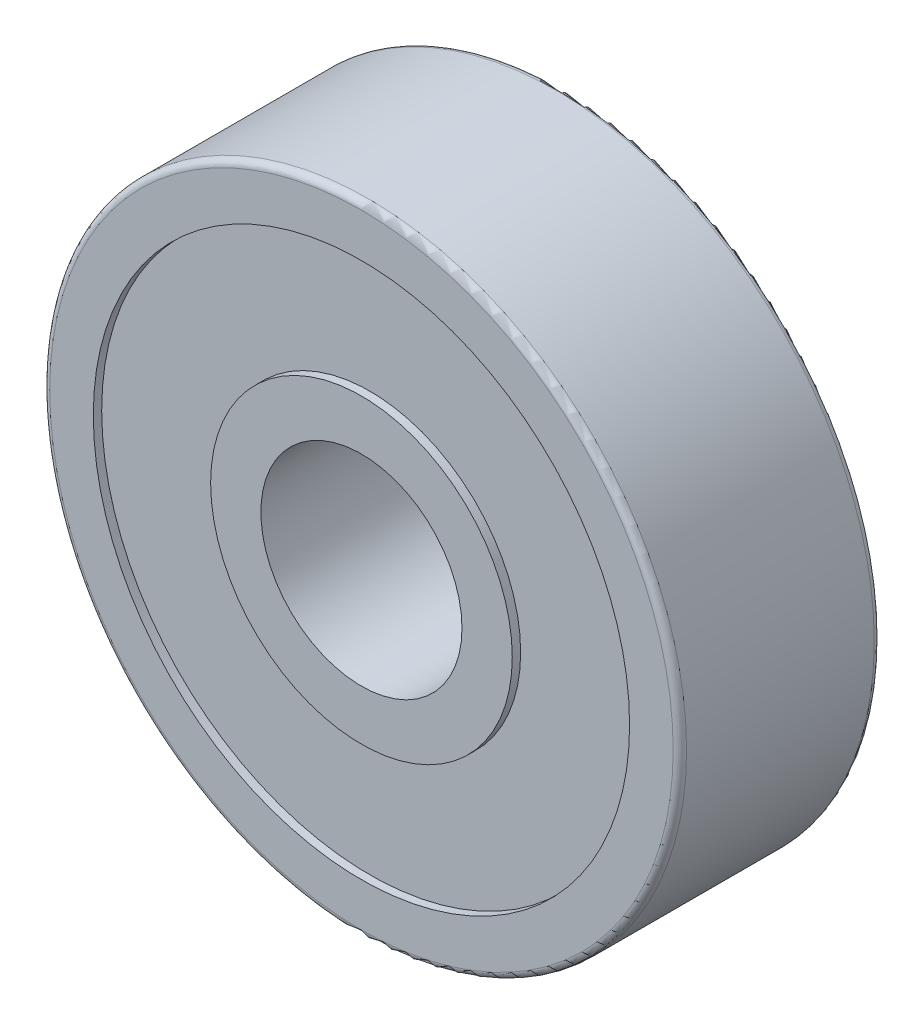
ISO-10303-21;
HEADER;
FILE_DESCRIPTION(('STEP AP214'),'2;1');
FILE_NAME('part.step','',(''),(''),'','','');
FILE_SCHEMA(('AUTOMOTIVE_DESIGN { 1 0 10303 214 1 1 1 1 }'));
ENDSEC;
DATA;
#1=APPLICATION_CONTEXT('core data for automotive mechanical design processes');
#2=APPLICATION_PROTOCOL_DEFINITION('international standard','automotive_design',2000,#1);
#3=PRODUCT_CONTEXT('',#1,'mechanical');
#4=PRODUCT('Part','Part','',(#3));
#5=PRODUCT_RELATED_PRODUCT_CATEGORY('part','',(#4));
#6=PRODUCT_DEFINITION_FORMATION('','',#4);
#7=PRODUCT_DEFINITION_CONTEXT('part definition',#1,'design');
#8=PRODUCT_DEFINITION('design','',#6,#7);
#9=PRODUCT_DEFINITION_SHAPE('','',#8);
#10=(LENGTH_UNIT() NAMED_UNIT(*) SI_UNIT(.MILLI.,.METRE.));
#11=(NAMED_UNIT(*) PLANE_ANGLE_UNIT() SI_UNIT($,.RADIAN.));
#12=(NAMED_UNIT(*) SI_UNIT($,.STERADIAN.) SOLID_ANGLE_UNIT());
#13=UNCERTAINTY_MEASURE_WITH_UNIT(LENGTH_MEASURE(1.E-05),#10,'distance_accuracy_value','');
#14=(GEOMETRIC_REPRESENTATION_CONTEXT(3) GLOBAL_UNCERTAINTY_ASSIGNED_CONTEXT((#13)) GLOBAL_UNIT_ASSIGNED_CONTEXT((#10,
#11,#12)) REPRESENTATION_CONTEXT('',''));
#15=CARTESIAN_POINT('',(0.,0.,0.));
#16=DIRECTION('',(0.,0.,1.));
#17=DIRECTION('',(1.,0.,0.));
#18=AXIS2_PLACEMENT_3D('',#15,#16,#17);
#19=CARTESIAN_POINT('',(0.,0.,0.));
#20=DIRECTION('',(0.,0.,1.));
#21=DIRECTION('',(1.,0.,0.));
#22=AXIS2_PLACEMENT_3D('',#19,#20,#21);
#23=CYLINDRICAL_SURFACE('',#22,3.);
#24=CARTESIAN_POINT('',(0.,0.,3.));
#25=DIRECTION('',(0.,0.,1.));
#26=DIRECTION('',(1.,0.,0.));
#27=AXIS2_PLACEMENT_3D('',#24,#25,#26);
#28=CIRCLE('',#27,3.);
#29=CARTESIAN_POINT('',(3.,0.,3.));
#30=VERTEX_POINT('',#29);
#31=EDGE_CURVE('E151',#30,#30,#28,.T.);
#32=ORIENTED_EDGE('',*,*,#31,.T.);
#33=EDGE_LOOP('',(#32));
#34=FACE_BOUND('',#33,.T.);
#35=CARTESIAN_POINT('',(0.,0.,-3.));
#36=DIRECTION('',(0.,0.,1.));
#37=DIRECTION('',(1.,0.,0.));
#38=AXIS2_PLACEMENT_3D('',#35,#36,#37);
#39=CIRCLE('',#38,3.);
#40=CARTESIAN_POINT('',(3.,0.,-3.));
#41=VERTEX_POINT('',#40);
#42=EDGE_CURVE('E17',#41,#41,#39,.T.);
#43=ORIENTED_EDGE('',*,*,#42,.F.);
#44=EDGE_LOOP('',(#43));
#45=FACE_BOUND('',#44,.T.);
#46=ADVANCED_FACE('F13',(#34,#45),#23,.F.);
#47=CARTESIAN_POINT('',(0.,0.,-3.));
#48=DIRECTION('',(0.,0.,-1.));
#49=DIRECTION('',(-1.,0.,0.));
#50=AXIS2_PLACEMENT_3D('',#47,#48,#49);
#51=PLANE('',#50);
#52=ORIENTED_EDGE('',*,*,#42,.T.);
#53=EDGE_LOOP('',(#52));
#54=FACE_BOUND('',#53,.T.);
#55=CARTESIAN_POINT('',(0.,0.,-3.));
#56=DIRECTION('',(0.,0.,1.));
#57=DIRECTION('',(1.,0.,0.));
#58=AXIS2_PLACEMENT_3D('',#55,#56,#57);
#59=CIRCLE('',#58,4.5);
#60=CARTESIAN_POINT('',(4.5,0.,-3.));
#61=VERTEX_POINT('',#60);
#62=EDGE_CURVE('E149',#61,#61,#59,.T.);
#63=ORIENTED_EDGE('',*,*,#62,.F.);
#64=EDGE_LOOP('',(#63));
#65=FACE_BOUND('',#64,.T.);
#66=ADVANCED_FACE('F99',(#54,#65),#51,.T.);
#67=CARTESIAN_POINT('',(0.,0.,3.));
#68=DIRECTION('',(0.,0.,-1.));
#69=DIRECTION('',(-1.,0.,0.));
#70=AXIS2_PLACEMENT_3D('',#67,#68,#69);
#71=PLANE('',#70);
#72=ORIENTED_EDGE('',*,*,#31,.F.);
#73=EDGE_LOOP('',(#72));
#74=FACE_BOUND('',#73,.T.);
#75=CARTESIAN_POINT('',(0.,0.,3.));
#76=DIRECTION('',(0.,0.,-1.));
#77=DIRECTION('',(-1.,0.,0.));
#78=AXIS2_PLACEMENT_3D('',#75,#76,#77);
#79=CIRCLE('',#78,4.5);
#80=CARTESIAN_POINT('',(-4.5,0.,3.));
#81=VERTEX_POINT('',#80);
#82=EDGE_CURVE('E146',#81,#81,#79,.T.);
#83=ORIENTED_EDGE('',*,*,#82,.F.);
#84=EDGE_LOOP('',(#83));
#85=FACE_BOUND('',#84,.T.);
#86=ADVANCED_FACE('F96',(#74,#85),#71,.F.);
#87=CARTESIAN_POINT('',(0.,0.,-3.));
#88=DIRECTION('',(0.,0.,1.));
#89=DIRECTION('',(1.,0.,0.));
#90=AXIS2_PLACEMENT_3D('',#87,#88,#89);
#91=CYLINDRICAL_SURFACE('',#90,4.5);
#92=ORIENTED_EDGE('',*,*,#62,.T.);
#93=EDGE_LOOP('',(#92));
#94=FACE_BOUND('',#93,.T.);
#95=CARTESIAN_POINT('',(0.,0.,-2.75));
#96=DIRECTION('',(0.,0.,1.));
#97=DIRECTION('',(1.,0.,0.));
#98=AXIS2_PLACEMENT_3D('',#95,#96,#97);
#99=CIRCLE('',#98,4.5);
#100=CARTESIAN_POINT('',(4.5,0.,-2.75));
#101=VERTEX_POINT('',#100);
#102=EDGE_CURVE('E143',#101,#101,#99,.F.);
#103=ORIENTED_EDGE('',*,*,#102,.T.);
#104=EDGE_LOOP('',(#103));
#105=FACE_BOUND('',#104,.T.);
#106=ADVANCED_FACE('F94',(#94,#105),#91,.T.);
#107=CARTESIAN_POINT('',(0.,0.,3.));
#108=DIRECTION('',(0.,0.,-1.));
#109=DIRECTION('',(-1.,0.,0.));
#110=AXIS2_PLACEMENT_3D('',#107,#108,#109);
#111=CYLINDRICAL_SURFACE('',#110,4.5);
#112=ORIENTED_EDGE('',*,*,#82,.T.);
#113=EDGE_LOOP('',(#112));
#114=FACE_BOUND('',#113,.T.);
#115=CARTESIAN_POINT('',(0.,0.,2.75));
#116=DIRECTION('',(0.,0.,-1.));
#117=DIRECTION('',(-1.,0.,0.));
#118=AXIS2_PLACEMENT_3D('',#115,#116,#117);
#119=CIRCLE('',#118,4.5);
#120=CARTESIAN_POINT('',(-4.5,0.,2.75));
#121=VERTEX_POINT('',#120);
#122=EDGE_CURVE('E140',#121,#121,#119,.F.);
#123=ORIENTED_EDGE('',*,*,#122,.T.);
#124=EDGE_LOOP('',(#123));
#125=FACE_BOUND('',#124,.T.);
#126=ADVANCED_FACE('F91',(#114,#125),#111,.T.);
#127=CARTESIAN_POINT('',(8.16,8.16,-2.75));
#128=DIRECTION('',(0.,0.,1.));
#129=DIRECTION('',(-1.,0.,0.));
#130=AXIS2_PLACEMENT_3D('',#127,#128,#129);
#131=PLANE('',#130);
#132=ORIENTED_EDGE('',*,*,#102,.F.);
#133=EDGE_LOOP('',(#132));
#134=FACE_BOUND('',#133,.T.);
#135=CARTESIAN_POINT('',(0.,0.,-2.75));
#136=DIRECTION('',(0.,0.,1.));
#137=DIRECTION('',(1.,0.,0.));
#138=AXIS2_PLACEMENT_3D('',#135,#136,#137);
#139=CIRCLE('',#138,8.);
#140=CARTESIAN_POINT('',(8.,0.,-2.75));
#141=VERTEX_POINT('',#140);
#142=EDGE_CURVE('E137',#141,#141,#139,.F.);
#143=ORIENTED_EDGE('',*,*,#142,.T.);
#144=EDGE_LOOP('',(#143));
#145=FACE_BOUND('',#144,.T.);
#146=ADVANCED_FACE('F89',(#134,#145),#131,.F.);
#147=CARTESIAN_POINT('',(0.,0.,2.75));
#148=DIRECTION('',(0.,0.,-1.));
#149=DIRECTION('',(-1.,0.,0.));
#150=AXIS2_PLACEMENT_3D('',#147,#148,#149);
#151=PLANE('',#150);
#152=ORIENTED_EDGE('',*,*,#122,.F.);
#153=EDGE_LOOP('',(#152));
#154=FACE_BOUND('',#153,.T.);
#155=CARTESIAN_POINT('',(0.,0.,2.75));
#156=DIRECTION('',(0.,0.,-1.));
#157=DIRECTION('',(-1.,0.,0.));
#158=AXIS2_PLACEMENT_3D('',#155,#156,#157);
#159=CIRCLE('',#158,8.);
#160=CARTESIAN_POINT('',(-8.,0.,2.75));
#161=VERTEX_POINT('',#160);
#162=EDGE_CURVE('E130',#161,#161,#159,.F.);
#163=ORIENTED_EDGE('',*,*,#162,.T.);
#164=EDGE_LOOP('',(#163));
#165=FACE_BOUND('',#164,.T.);
#166=ADVANCED_FACE('F86',(#154,#165),#151,.F.);
#167=CARTESIAN_POINT('',(0.,0.,-3.));
#168=DIRECTION('',(0.,0.,1.));
#169=DIRECTION('',(1.,0.,0.));
#170=AXIS2_PLACEMENT_3D('',#167,#168,#169);
#171=CYLINDRICAL_SURFACE('',#170,8.);
#172=CARTESIAN_POINT('',(0.,0.,-3.));
#173=DIRECTION('',(0.,0.,1.));
#174=DIRECTION('',(1.,0.,0.));
#175=AXIS2_PLACEMENT_3D('',#172,#173,#174);
#176=CIRCLE('',#175,8.);
#177=CARTESIAN_POINT('',(8.,0.,-3.));
#178=VERTEX_POINT('',#177);
#179=EDGE_CURVE('E126',#178,#178,#176,.T.);
#180=ORIENTED_EDGE('',*,*,#179,.F.);
#181=EDGE_LOOP('',(#180));
#182=FACE_BOUND('',#181,.T.);
#183=ORIENTED_EDGE('',*,*,#142,.F.);
#184=EDGE_LOOP('',(#183));
#185=FACE_BOUND('',#184,.T.);
#186=ADVANCED_FACE('F15',(#182,#185),#171,.F.);
#187=CARTESIAN_POINT('',(0.,0.,3.));
#188=DIRECTION('',(0.,0.,-1.));
#189=DIRECTION('',(-1.,0.,0.));
#190=AXIS2_PLACEMENT_3D('',#187,#188,#189);
#191=CYLINDRICAL_SURFACE('',#190,8.);
#192=CARTESIAN_POINT('',(0.,0.,3.));
#193=DIRECTION('',(0.,0.,-1.));
#194=DIRECTION('',(-1.,0.,0.));
#195=AXIS2_PLACEMENT_3D('',#192,#193,#194);
#196=CIRCLE('',#195,8.);
#197=CARTESIAN_POINT('',(-8.,0.,3.));
#198=VERTEX_POINT('',#197);
#199=EDGE_CURVE('E124',#198,#198,#196,.F.);
#200=ORIENTED_EDGE('',*,*,#199,.T.);
#201=EDGE_LOOP('',(#200));
#202=FACE_BOUND('',#201,.T.);
#203=ORIENTED_EDGE('',*,*,#162,.F.);
#204=EDGE_LOOP('',(#203));
#205=FACE_BOUND('',#204,.T.);
#206=ADVANCED_FACE('F80',(#202,#205),#191,.F.);
#207=CARTESIAN_POINT('',(0.,0.,-3.));
#208=DIRECTION('',(0.,0.,-1.));
#209=DIRECTION('',(-1.,0.,0.));
#210=AXIS2_PLACEMENT_3D('',#207,#208,#209);
#211=PLANE('',#210);
#212=ORIENTED_EDGE('',*,*,#179,.T.);
#213=EDGE_LOOP('',(#212));
#214=FACE_BOUND('',#213,.T.);
#215=CARTESIAN_POINT('',(0.,0.,-3.));
#216=DIRECTION('',(0.,0.,1.));
#217=DIRECTION('',(1.,0.,0.));
#218=AXIS2_PLACEMENT_3D('',#215,#216,#217);
#219=CIRCLE('',#218,9.3);
#220=CARTESIAN_POINT('',(9.3,0.,-3.));
#221=VERTEX_POINT('',#220);
#222=EDGE_CURVE('E64',#221,#221,#219,.T.);
#223=ORIENTED_EDGE('',*,*,#222,.F.);
#224=EDGE_LOOP('',(#223));
#225=FACE_BOUND('',#224,.T.);
#226=ADVANCED_FACE('F70',(#214,#225),#211,.T.);
#227=CARTESIAN_POINT('',(0.,0.,3.));
#228=DIRECTION('',(0.,0.,-1.));
#229=DIRECTION('',(-1.,0.,0.));
#230=AXIS2_PLACEMENT_3D('',#227,#228,#229);
#231=PLANE('',#230);
#232=ORIENTED_EDGE('',*,*,#199,.F.);
#233=EDGE_LOOP('',(#232));
#234=FACE_BOUND('',#233,.T.);
#235=CARTESIAN_POINT('',(0.,0.,3.));
#236=DIRECTION('',(0.,0.,-1.));
#237=DIRECTION('',(1.,0.,0.));
#238=AXIS2_PLACEMENT_3D('',#235,#236,#237);
#239=CIRCLE('',#238,9.3);
#240=CARTESIAN_POINT('',(9.3,0.,3.));
#241=VERTEX_POINT('',#240);
#242=EDGE_CURVE('E26',#241,#241,#239,.T.);
#243=ORIENTED_EDGE('',*,*,#242,.F.);
#244=EDGE_LOOP('',(#243));
#245=FACE_BOUND('',#244,.T.);
#246=ADVANCED_FACE('F79',(#234,#245),#231,.F.);
#247=CARTESIAN_POINT('',(0.,0.,-2.8));
#248=DIRECTION('',(0.,0.,1.));
#249=DIRECTION('',(1.,0.,0.));
#250=AXIS2_PLACEMENT_3D('',#247,#248,#249);
#251=TOROIDAL_SURFACE('',#250,9.3,0.2);
#252=CARTESIAN_POINT('',(0.,0.,-2.8));
#253=DIRECTION('',(0.,0.,1.));
#254=DIRECTION('',(1.,0.,0.));
#255=AXIS2_PLACEMENT_3D('',#252,#253,#254);
#256=CIRCLE('',#255,9.5);
#257=CARTESIAN_POINT('',(9.5,0.,-2.8));
#258=VERTEX_POINT('',#257);
#259=EDGE_CURVE('E21',#258,#258,#256,.T.);
#260=ORIENTED_EDGE('',*,*,#259,.F.);
#261=EDGE_LOOP('',(#260));
#262=FACE_BOUND('',#261,.T.);
#263=ORIENTED_EDGE('',*,*,#222,.T.);
#264=EDGE_LOOP('',(#263));
#265=FACE_BOUND('',#264,.T.);
#266=ADVANCED_FACE('F44',(#262,#265),#251,.T.);
#267=CARTESIAN_POINT('',(0.,0.,2.8));
#268=DIRECTION('',(0.,0.,-1.));
#269=DIRECTION('',(-1.,0.,0.));
#270=AXIS2_PLACEMENT_3D('',#267,#268,#269);
#271=TOROIDAL_SURFACE('',#270,9.3,0.2);
#272=CARTESIAN_POINT('',(0.,0.,2.8));
#273=DIRECTION('',(0.,0.,1.));
#274=DIRECTION('',(1.,0.,0.));
#275=AXIS2_PLACEMENT_3D('',#272,#273,#274);
#276=CIRCLE('',#275,9.5);
#277=CARTESIAN_POINT('',(9.5,0.,2.8));
#278=VERTEX_POINT('',#277);
#279=EDGE_CURVE('E9',#278,#278,#276,.F.);
#280=ORIENTED_EDGE('',*,*,#279,.F.);
#281=EDGE_LOOP('',(#280));
#282=FACE_BOUND('',#281,.T.);
#283=ORIENTED_EDGE('',*,*,#242,.T.);
#284=EDGE_LOOP('',(#283));
#285=FACE_BOUND('',#284,.T.);
#286=ADVANCED_FACE('F38',(#282,#285),#271,.T.);
#287=CARTESIAN_POINT('',(0.,0.,0.));
#288=DIRECTION('',(0.,0.,1.));
#289=DIRECTION('',(1.,0.,0.));
#290=AXIS2_PLACEMENT_3D('',#287,#288,#289);
#291=CYLINDRICAL_SURFACE('',#290,9.5);
#292=ORIENTED_EDGE('',*,*,#279,.T.);
#293=EDGE_LOOP('',(#292));
#294=FACE_BOUND('',#293,.T.);
#295=ORIENTED_EDGE('',*,*,#259,.T.);
#296=EDGE_LOOP('',(#295));
#297=FACE_BOUND('',#296,.T.);
#298=ADVANCED_FACE('F43',(#294,#297),#291,.T.);
#299=CLOSED_SHELL('',(#46,#66,#86,#106,#126,#146,#166,#186,#206,#226,#246,#266,#286,#298));
#300=MANIFOLD_SOLID_BREP('B1',#299);
#301=ADVANCED_BREP_SHAPE_REPRESENTATION('',(#18,#300),#14);
#302=SHAPE_DEFINITION_REPRESENTATION(#9,#301);
ENDSEC;
END-ISO-10303-21;
